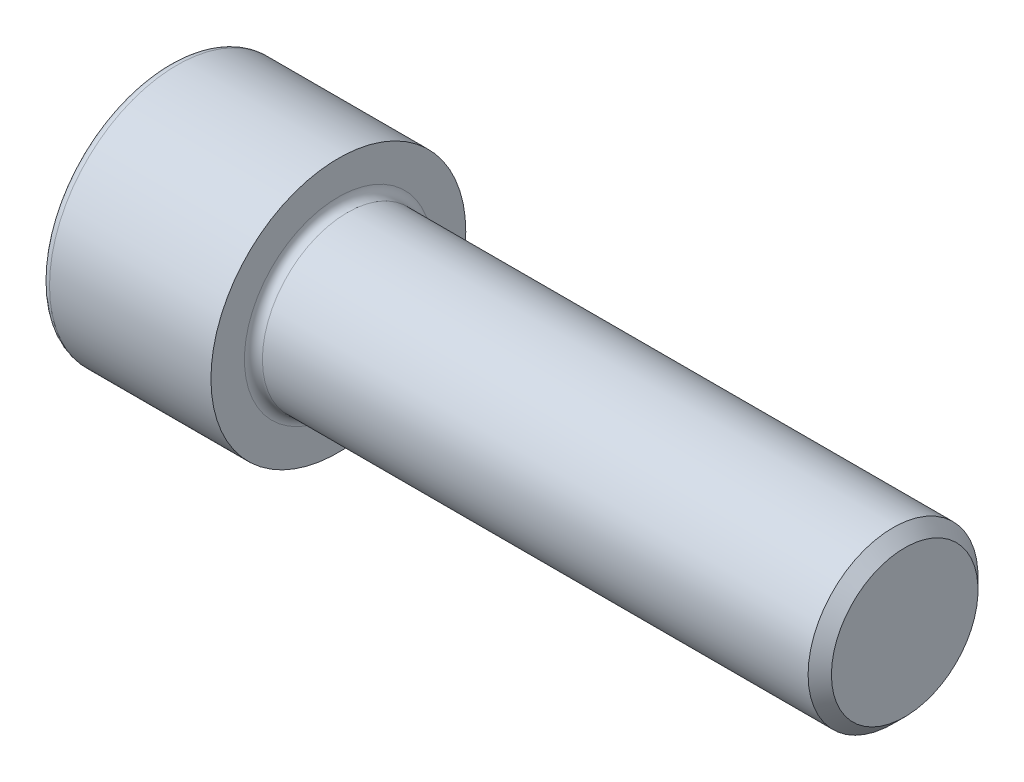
from build123d import *

# Parameters (mm, degrees)
FILLET1_R   = 1.27
FILLET2_R   = 1.2
HEX_2_DEPTH = 12.573


with BuildPart() as part:
    # BodySke → Base-Revolve (revolve)
    with BuildSketch(Plane.XY, mode=Mode.PRIVATE) as base_revolve_sk:
        Polygon((0, 0), (0, 18), (24, 18), (24, 12), (102.352, 12), (104, 10.352), (104, 0), align=None)
    revolve(base_revolve_sk.sketch.rotate(Axis((-31.75, 0, 0), (1, 0, 0)), 90), axis=Axis((-31.75, 0, 0), (1, 0, 0)))

    # Fillet1
    fillet1_edges = [part.edges().sort_by_distance(p)[0] for p in [
        (24, 0, -12),
    ]]
    fillet(fillet1_edges, radius=FILLET1_R)

    # Fillet2
    fillet2_edges = [part.edges().sort_by_distance(p)[0] for p in [
        (0, 0, -18),
    ]]
    fillet(fillet2_edges, radius=FILLET2_R)

    # Sketch2 → Hex-PreBroach (revolve, cut)
    with BuildSketch(Plane.XY, mode=Mode.PRIVATE) as hex_prebroach_sk:
        Polygon((0, 9.6375), (12.573, 9.6375), (18.137213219, 0), (0, 0), align=None)
    revolve(hex_prebroach_sk.sketch.rotate(Axis((0, 0, 0), (1, 0, 0)), 90), axis=Axis((0, 0, 0), (1, 0, 0)), mode=Mode.SUBTRACT)

    # Sketch3 → Hex 2 (cut)
    with BuildSketch(Plane(origin=(0, 0, 0), x_dir=(0, 0.500000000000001, 0.866025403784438), z_dir=(-1, 0, 0))):
        Polygon((5.564213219, 9.6375), (-5.564213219, 9.6375), (-11.128426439, 0), (-5.564213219, -9.6375), (5.564213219, -9.6375), (11.128426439, 0), align=None)
    extrude(amount=-HEX_2_DEPTH, mode=Mode.SUBTRACT)


solid = part.part
